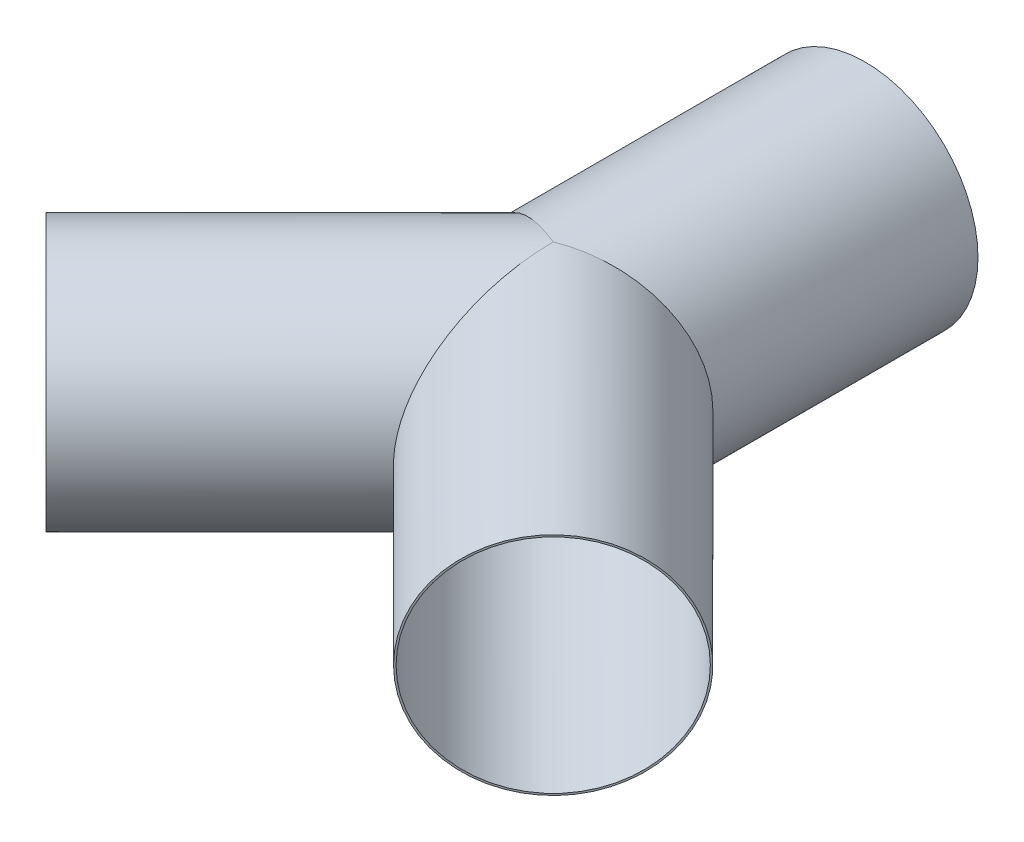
ISO-10303-21;
HEADER;
FILE_DESCRIPTION(('STEP AP214'),'2;1');
FILE_NAME('part.step','',(''),(''),'','','');
FILE_SCHEMA(('AUTOMOTIVE_DESIGN { 1 0 10303 214 1 1 1 1 }'));
ENDSEC;
DATA;
#1=APPLICATION_CONTEXT('core data for automotive mechanical design processes');
#2=APPLICATION_PROTOCOL_DEFINITION('international standard','automotive_design',2000,#1);
#3=PRODUCT_CONTEXT('',#1,'mechanical');
#4=PRODUCT('Part','Part','',(#3));
#5=PRODUCT_RELATED_PRODUCT_CATEGORY('part','',(#4));
#6=PRODUCT_DEFINITION_FORMATION('','',#4);
#7=PRODUCT_DEFINITION_CONTEXT('part definition',#1,'design');
#8=PRODUCT_DEFINITION('design','',#6,#7);
#9=PRODUCT_DEFINITION_SHAPE('','',#8);
#10=(LENGTH_UNIT() NAMED_UNIT(*) SI_UNIT(.MILLI.,.METRE.));
#11=(NAMED_UNIT(*) PLANE_ANGLE_UNIT() SI_UNIT($,.RADIAN.));
#12=(NAMED_UNIT(*) SI_UNIT($,.STERADIAN.) SOLID_ANGLE_UNIT());
#13=UNCERTAINTY_MEASURE_WITH_UNIT(LENGTH_MEASURE(1.E-05),#10,'distance_accuracy_value','');
#14=(GEOMETRIC_REPRESENTATION_CONTEXT(3) GLOBAL_UNCERTAINTY_ASSIGNED_CONTEXT((#13)) GLOBAL_UNIT_ASSIGNED_CONTEXT((#10,
#11,#12)) REPRESENTATION_CONTEXT('',''));
#15=CARTESIAN_POINT('',(0.,0.,0.));
#16=DIRECTION('',(0.,0.,1.));
#17=DIRECTION('',(1.,0.,0.));
#18=AXIS2_PLACEMENT_3D('',#15,#16,#17);
#19=CARTESIAN_POINT('',(707.444263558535,0.,707.444263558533));
#20=DIRECTION('',(0.707106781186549,0.,0.707106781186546));
#21=DIRECTION('',(-0.707106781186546,0.,0.707106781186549));
#22=AXIS2_PLACEMENT_3D('',#19,#20,#21);
#23=PLANE('',#22);
#24=CARTESIAN_POINT('',(707.444263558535,0.,707.444263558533));
#25=DIRECTION('',(-0.707106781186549,0.,-0.707106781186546));
#26=DIRECTION('',(-0.707106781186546,0.,0.707106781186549));
#27=AXIS2_PLACEMENT_3D('',#24,#25,#26);
#28=CIRCLE('',#27,315.);
#29=CARTESIAN_POINT('',(484.705627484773,0.,930.182899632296));
#30=VERTEX_POINT('',#29);
#31=EDGE_CURVE('E77',#30,#30,#28,.T.);
#32=ORIENTED_EDGE('',*,*,#31,.F.);
#33=EDGE_LOOP('',(#32));
#34=FACE_BOUND('',#33,.T.);
#35=CARTESIAN_POINT('',(707.444263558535,0.,707.444263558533));
#36=DIRECTION('',(0.707106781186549,0.,0.707106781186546));
#37=DIRECTION('',(0.707106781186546,0.,-0.707106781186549));
#38=AXIS2_PLACEMENT_3D('',#35,#36,#37);
#39=CIRCLE('',#38,310.);
#40=CARTESIAN_POINT('',(926.647365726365,0.,488.241161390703));
#41=VERTEX_POINT('',#40);
#42=EDGE_CURVE('E66',#41,#41,#39,.F.);
#43=ORIENTED_EDGE('',*,*,#42,.T.);
#44=EDGE_LOOP('',(#43));
#45=FACE_BOUND('',#44,.T.);
#46=ADVANCED_FACE('F32',(#34,#45),#23,.T.);
#47=CARTESIAN_POINT('',(0.,0.,-870.));
#48=DIRECTION('',(0.,0.,1.));
#49=DIRECTION('',(1.,0.,0.));
#50=AXIS2_PLACEMENT_3D('',#47,#48,#49);
#51=CYLINDRICAL_SURFACE('',#50,315.);
#52=CARTESIAN_POINT('',(-2.22044604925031E-13,0.,-6.10622663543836E-13));
#53=DIRECTION('',(0.382683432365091,0.,0.923879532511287));
#54=DIRECTION('',(-0.923879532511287,0.,0.38268343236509));
#55=AXIS2_PLACEMENT_3D('',#52,#53,#54);
#56=ELLIPSE('',#55,340.953543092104,315.);
#57=CARTESIAN_POINT('',(0.,-315.,0.));
#58=VERTEX_POINT('',#57);
#59=CARTESIAN_POINT('',(0.,315.,0.));
#60=VERTEX_POINT('',#59);
#61=EDGE_CURVE('E46',#58,#60,#56,.T.);
#62=ORIENTED_EDGE('',*,*,#61,.F.);
#63=CARTESIAN_POINT('',(2.22044604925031E-13,0.,-6.10622663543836E-13));
#64=DIRECTION('',(-0.382683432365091,0.,0.923879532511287));
#65=DIRECTION('',(0.923879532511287,0.,0.38268343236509));
#66=AXIS2_PLACEMENT_3D('',#63,#64,#65);
#67=ELLIPSE('',#66,340.953543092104,315.);
#68=EDGE_CURVE('E40',#58,#60,#67,.F.);
#69=ORIENTED_EDGE('',*,*,#68,.T.);
#70=EDGE_LOOP('',(#62,#69));
#71=FACE_BOUND('',#70,.T.);
#72=CARTESIAN_POINT('',(0.,0.,-870.));
#73=DIRECTION('',(0.,0.,1.));
#74=DIRECTION('',(1.,0.,0.));
#75=AXIS2_PLACEMENT_3D('',#72,#73,#74);
#76=CIRCLE('',#75,315.);
#77=CARTESIAN_POINT('',(315.,0.,-870.));
#78=VERTEX_POINT('',#77);
#79=EDGE_CURVE('E11',#78,#78,#76,.T.);
#80=ORIENTED_EDGE('',*,*,#79,.T.);
#81=EDGE_LOOP('',(#80));
#82=FACE_BOUND('',#81,.T.);
#83=ADVANCED_FACE('F34',(#71,#82),#51,.T.);
#84=CARTESIAN_POINT('',(0.,0.,-870.));
#85=DIRECTION('',(0.,0.,1.));
#86=DIRECTION('',(1.,0.,0.));
#87=AXIS2_PLACEMENT_3D('',#84,#85,#86);
#88=PLANE('',#87);
#89=CARTESIAN_POINT('',(0.,0.,-870.));
#90=DIRECTION('',(0.,0.,1.));
#91=DIRECTION('',(1.,0.,0.));
#92=AXIS2_PLACEMENT_3D('',#89,#90,#91);
#93=CIRCLE('',#92,310.);
#94=CARTESIAN_POINT('',(310.,0.,-870.));
#95=VERTEX_POINT('',#94);
#96=EDGE_CURVE('E74',#95,#95,#93,.T.);
#97=ORIENTED_EDGE('',*,*,#96,.T.);
#98=EDGE_LOOP('',(#97));
#99=FACE_BOUND('',#98,.T.);
#100=ORIENTED_EDGE('',*,*,#79,.F.);
#101=EDGE_LOOP('',(#100));
#102=FACE_BOUND('',#101,.T.);
#103=ADVANCED_FACE('F99',(#99,#102),#88,.F.);
#104=CARTESIAN_POINT('',(-707.444263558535,0.,707.444263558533));
#105=DIRECTION('',(0.707106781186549,0.,-0.707106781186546));
#106=DIRECTION('',(-0.707106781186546,0.,-0.707106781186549));
#107=AXIS2_PLACEMENT_3D('',#104,#105,#106);
#108=CYLINDRICAL_SURFACE('',#107,315.);
#109=ORIENTED_EDGE('',*,*,#68,.F.);
#110=CARTESIAN_POINT('',(0.,0.,0.));
#111=DIRECTION('',(1.,0.,0.));
#112=DIRECTION('',(0.,0.,-1.));
#113=AXIS2_PLACEMENT_3D('',#110,#111,#112);
#114=ELLIPSE('',#113,445.477272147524,315.);
#115=EDGE_CURVE('E49',#58,#60,#114,.F.);
#116=ORIENTED_EDGE('',*,*,#115,.T.);
#117=EDGE_LOOP('',(#109,#116));
#118=FACE_BOUND('',#117,.T.);
#119=CARTESIAN_POINT('',(-707.444263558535,0.,707.444263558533));
#120=DIRECTION('',(-0.707106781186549,0.,0.707106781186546));
#121=DIRECTION('',(0.707106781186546,0.,0.707106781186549));
#122=AXIS2_PLACEMENT_3D('',#119,#120,#121);
#123=CIRCLE('',#122,315.);
#124=CARTESIAN_POINT('',(-484.705627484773,0.,930.182899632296));
#125=VERTEX_POINT('',#124);
#126=EDGE_CURVE('E88',#125,#125,#123,.T.);
#127=ORIENTED_EDGE('',*,*,#126,.F.);
#128=EDGE_LOOP('',(#127));
#129=FACE_BOUND('',#128,.T.);
#130=ADVANCED_FACE('F95',(#118,#129),#108,.T.);
#131=CARTESIAN_POINT('',(-707.444263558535,0.,707.444263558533));
#132=DIRECTION('',(-0.707106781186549,0.,0.707106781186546));
#133=DIRECTION('',(0.707106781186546,0.,0.707106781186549));
#134=AXIS2_PLACEMENT_3D('',#131,#132,#133);
#135=PLANE('',#134);
#136=CARTESIAN_POINT('',(-707.444263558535,0.,707.444263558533));
#137=DIRECTION('',(-0.707106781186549,0.,0.707106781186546));
#138=DIRECTION('',(0.707106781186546,0.,0.707106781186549));
#139=AXIS2_PLACEMENT_3D('',#136,#137,#138);
#140=CIRCLE('',#139,310.);
#141=CARTESIAN_POINT('',(-488.241161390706,0.,926.647365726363));
#142=VERTEX_POINT('',#141);
#143=EDGE_CURVE('E70',#142,#142,#140,.T.);
#144=ORIENTED_EDGE('',*,*,#143,.F.);
#145=EDGE_LOOP('',(#144));
#146=FACE_BOUND('',#145,.T.);
#147=ORIENTED_EDGE('',*,*,#126,.T.);
#148=EDGE_LOOP('',(#147));
#149=FACE_BOUND('',#148,.T.);
#150=ADVANCED_FACE('F98',(#146,#149),#135,.T.);
#151=CARTESIAN_POINT('',(707.444263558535,0.,707.444263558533));
#152=DIRECTION('',(-0.707106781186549,0.,-0.707106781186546));
#153=DIRECTION('',(-0.707106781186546,0.,0.707106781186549));
#154=AXIS2_PLACEMENT_3D('',#151,#152,#153);
#155=CYLINDRICAL_SURFACE('',#154,315.);
#156=ORIENTED_EDGE('',*,*,#31,.T.);
#157=EDGE_LOOP('',(#156));
#158=FACE_BOUND('',#157,.T.);
#159=ORIENTED_EDGE('',*,*,#115,.F.);
#160=ORIENTED_EDGE('',*,*,#61,.T.);
#161=EDGE_LOOP('',(#159,#160));
#162=FACE_BOUND('',#161,.T.);
#163=ADVANCED_FACE('F104',(#158,#162),#155,.T.);
#164=CARTESIAN_POINT('',(0.,0.,-870.));
#165=DIRECTION('',(0.,0.,1.));
#166=DIRECTION('',(1.,0.,0.));
#167=AXIS2_PLACEMENT_3D('',#164,#165,#166);
#168=CYLINDRICAL_SURFACE('',#167,310.);
#169=CARTESIAN_POINT('',(-2.22044604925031E-13,0.,-6.10622663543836E-13));
#170=DIRECTION('',(0.382683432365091,0.,0.923879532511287));
#171=DIRECTION('',(-0.923879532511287,0.,0.38268343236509));
#172=AXIS2_PLACEMENT_3D('',#169,#170,#171);
#173=ELLIPSE('',#172,335.541582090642,310.);
#174=CARTESIAN_POINT('',(0.,-310.,0.));
#175=VERTEX_POINT('',#174);
#176=CARTESIAN_POINT('',(0.,310.,0.));
#177=VERTEX_POINT('',#176);
#178=EDGE_CURVE('E65',#175,#177,#173,.T.);
#179=ORIENTED_EDGE('',*,*,#178,.T.);
#180=CARTESIAN_POINT('',(2.22044604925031E-13,0.,-6.10622663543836E-13));
#181=DIRECTION('',(-0.382683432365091,0.,0.923879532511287));
#182=DIRECTION('',(0.923879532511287,0.,0.38268343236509));
#183=AXIS2_PLACEMENT_3D('',#180,#181,#182);
#184=ELLIPSE('',#183,335.541582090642,310.);
#185=EDGE_CURVE('E63',#175,#177,#184,.F.);
#186=ORIENTED_EDGE('',*,*,#185,.F.);
#187=EDGE_LOOP('',(#179,#186));
#188=FACE_BOUND('',#187,.T.);
#189=ORIENTED_EDGE('',*,*,#96,.F.);
#190=EDGE_LOOP('',(#189));
#191=FACE_BOUND('',#190,.T.);
#192=ADVANCED_FACE('F72',(#188,#191),#168,.F.);
#193=CARTESIAN_POINT('',(-707.444263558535,0.,707.444263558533));
#194=DIRECTION('',(0.707106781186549,0.,-0.707106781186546));
#195=DIRECTION('',(-0.707106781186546,0.,-0.707106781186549));
#196=AXIS2_PLACEMENT_3D('',#193,#194,#195);
#197=CYLINDRICAL_SURFACE('',#196,310.);
#198=ORIENTED_EDGE('',*,*,#185,.T.);
#199=CARTESIAN_POINT('',(0.,0.,0.));
#200=DIRECTION('',(1.,0.,0.));
#201=DIRECTION('',(0.,0.,-1.));
#202=AXIS2_PLACEMENT_3D('',#199,#200,#201);
#203=ELLIPSE('',#202,438.406204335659,310.);
#204=EDGE_CURVE('E58',#175,#177,#203,.F.);
#205=ORIENTED_EDGE('',*,*,#204,.F.);
#206=EDGE_LOOP('',(#198,#205));
#207=FACE_BOUND('',#206,.T.);
#208=ORIENTED_EDGE('',*,*,#143,.T.);
#209=EDGE_LOOP('',(#208));
#210=FACE_BOUND('',#209,.T.);
#211=ADVANCED_FACE('F60',(#207,#210),#197,.F.);
#212=CARTESIAN_POINT('',(707.444263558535,0.,707.444263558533));
#213=DIRECTION('',(-0.707106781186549,0.,-0.707106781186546));
#214=DIRECTION('',(-0.707106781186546,0.,0.707106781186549));
#215=AXIS2_PLACEMENT_3D('',#212,#213,#214);
#216=CYLINDRICAL_SURFACE('',#215,310.);
#217=ORIENTED_EDGE('',*,*,#42,.F.);
#218=EDGE_LOOP('',(#217));
#219=FACE_BOUND('',#218,.T.);
#220=ORIENTED_EDGE('',*,*,#204,.T.);
#221=ORIENTED_EDGE('',*,*,#178,.F.);
#222=EDGE_LOOP('',(#220,#221));
#223=FACE_BOUND('',#222,.T.);
#224=ADVANCED_FACE('F68',(#219,#223),#216,.F.);
#225=CLOSED_SHELL('',(#46,#83,#103,#130,#150,#163,#192,#211,#224));
#226=MANIFOLD_SOLID_BREP('B2',#225);
#227=ADVANCED_BREP_SHAPE_REPRESENTATION('',(#18,#226),#14);
#228=SHAPE_DEFINITION_REPRESENTATION(#9,#227);
ENDSEC;
END-ISO-10303-21;
